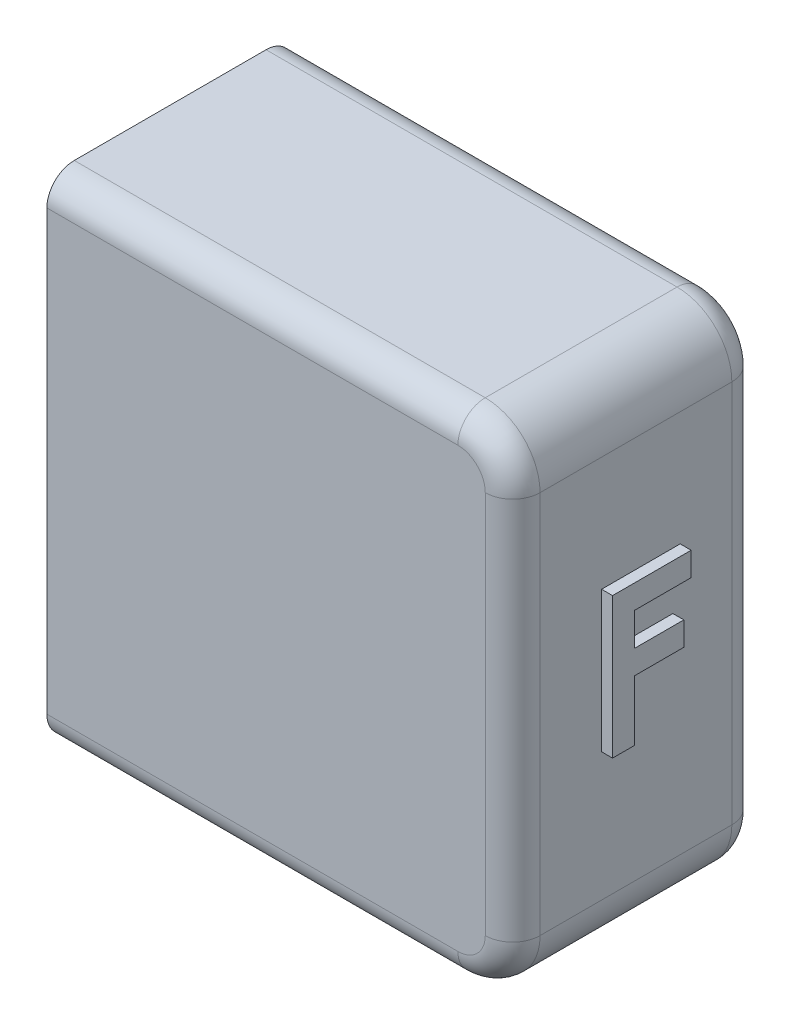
from build123d import *

# Parameters (mm, degrees)
SKETCH1_W           = 17
SKETCH1_H           = 18
BOSS_EXTRUDE1_DEPTH = 2
BOSS_EXTRUDE2_DEPTH = 5
BOSS_EXTRUDE6_REACH = 20.055
SKETCH12_W          = 2
SKETCH12_H          = 0.8
SKETCH6_W           = 17
SKETCH6_H           = 18
BOSS_EXTRUDE4_DEPTH = 2
FILLET4_R           = 2
FILLET6_R           = 1
BOSS_EXTRUDE7_DEPTH = 0.4


with BuildPart() as part:
    # Sketch1 → Boss-Extrude1 (new body)
    with BuildSketch(Plane.XY):
        Rectangle(SKETCH1_W, SKETCH1_H)
    extrude(amount=BOSS_EXTRUDE1_DEPTH)

    # Sketch3 → Boss-Extrude2 (add)
    with BuildSketch(Plane.XY.offset(2)):
        Polygon((-8.5, -9), (8.5, -9), (8.5, 9), (-8.5, 9), (-8.5, 6.2), (-5.5, 6.2), (-5.5, 7), (5.5, 7), (5.5, -7), (-5.5, -7), (-5.5, -6.2), (-8.5, -6.2), align=None)
    extrude(amount=BOSS_EXTRUDE2_DEPTH)

    # Sketch12 → Boss-Extrude6 (add, up to next)
    with BuildSketch(Plane(origin=(-5.5, 0, 0), x_dir=(0, 0, -1), z_dir=(1, 0, 0)), mode=Mode.PRIVATE) as boss_extrude6_sk1:
        with Locations((-4.5, -6.6)):
            Rectangle(SKETCH12_W, SKETCH12_H)
    boss_extrude6_tool1 = extrude(boss_extrude6_sk1.sketch, amount=BOSS_EXTRUDE6_REACH, mode=Mode.PRIVATE) - part.part
    # Sketch12 → Boss-Extrude6 (add, up to next)
    with BuildSketch(Plane(origin=(-5.5, 0, 0), x_dir=(0, 0, -1), z_dir=(1, 0, 0)), mode=Mode.PRIVATE) as boss_extrude6_sk2:
        with Locations((-4.5, 6.6)):
            Rectangle(SKETCH12_W, SKETCH12_H)
    boss_extrude6_tool2 = extrude(boss_extrude6_sk2.sketch, amount=BOSS_EXTRUDE6_REACH, mode=Mode.PRIVATE) - part.part
    add(boss_extrude6_tool1.solids().sort_by_distance((-5.5, -6.6, 4.5))[0])
    add(boss_extrude6_tool2.solids().sort_by_distance((-5.5, 6.6, 4.5))[0])

    # Sketch6 → Boss-Extrude4 (add)
    with BuildSketch(Plane.XY.offset(7)):
        Rectangle(SKETCH6_W, SKETCH6_H)
    extrude(amount=BOSS_EXTRUDE4_DEPTH)

    # Fillet4
    fillet4_edges = [part.edges().sort_by_distance(p)[0] for p in [
        (8.5, -9, 4.5),
        (8.5, 9, 4.5),
    ]]
    fillet(fillet4_edges, radius=FILLET4_R)

    # Fillet6
    fillet6_edges = [part.edges().sort_by_distance(p)[0] for p in [
        (-1, -9, 0),
        (-1, -9, 9),
        (8.5, 0, 0),
        (8.5, 0, 9),
        (-1, 9, 0),
        (7.914213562, 8.414213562, 0),
        (7.914213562, -8.414213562, 0),
        (-1, 9, 9),
        (7.914213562, 8.414213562, 9),
        (7.914213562, -8.414213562, 9),
    ]]
    fillet(fillet6_edges, radius=FILLET6_R)

    # Sketch13 → Boss-Extrude7 (add)
    with BuildSketch(Plane(origin=(8.5, 0, 0), x_dir=(0, 0, -1), z_dir=(1, 0, 0))):
        Polygon((-5.754173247, -2.31298999), (-5.754173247, 2.82364738), (-2.885661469, 2.82364738), (-2.885661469, 1.956422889), (-4.953658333, 1.956422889), (-4.953658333, 0.755650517), (-3.152499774, 0.755650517), (-3.152499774, -0.111573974), (-4.953658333, -0.111573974), (-4.953658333, -2.31298999), align=None)
    extrude(amount=BOSS_EXTRUDE7_DEPTH)


solid = part.part
